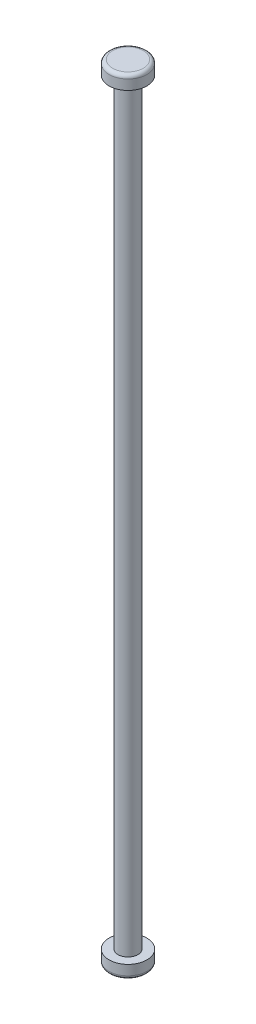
from build123d import *

# Parameters (mm, degrees)
SKETCH18_R          = 0.55
BOSS_EXTRUDE1_DEPTH = 21
SKETCH19_R          = 1.05
BOSS_EXTRUDE2_DEPTH = 0.75
FILLET2_R           = 0.2
FILLET3_R           = 0.2
SCALE1_SCALE        = 0.7


with BuildPart() as part:
    # Sketch18 → Boss-Extrude1 (new, symmetric)
    with BuildSketch(Plane(origin=(0, 0, 0), x_dir=(1, 0, 0), z_dir=(0, 1, 0))):
        with Locations(Location((0, 0, 0), (0, 0, 270))):
            Circle(SKETCH18_R)
    extrude(amount=BOSS_EXTRUDE1_DEPTH, both=True)

    # Sketch19 → Boss-Extrude2 (add)
    with BuildSketch(Plane(origin=(0, 21, 0), x_dir=(1, 0, 0), z_dir=(0, 1, 0))):
        with Locations(Location((0, 0, 0), (0, 0, 270))):
            Circle(SKETCH19_R)
    boss_extrude2 = extrude(amount=BOSS_EXTRUDE2_DEPTH)

    # Mirror1: Boss-Extrude2 across plane
    add(boss_extrude2.mirror(Plane.ZX))

    # Fillet2
    fillet2_edges = [part.edges().sort_by_distance(p)[0] for p in [
        (0, 21.75, -1.05),
    ]]
    fillet(fillet2_edges, radius=FILLET2_R)

    # Fillet3
    fillet3_edges = [part.edges().sort_by_distance(p)[0] for p in [
        (0, -21.75, -1.05),
    ]]
    fillet(fillet3_edges, radius=FILLET3_R)


with BuildPart() as part_1:
    # Scale1: scaled about (0, 0, 0)
    add(part.part.scale(SCALE1_SCALE))


solid = part_1.part
